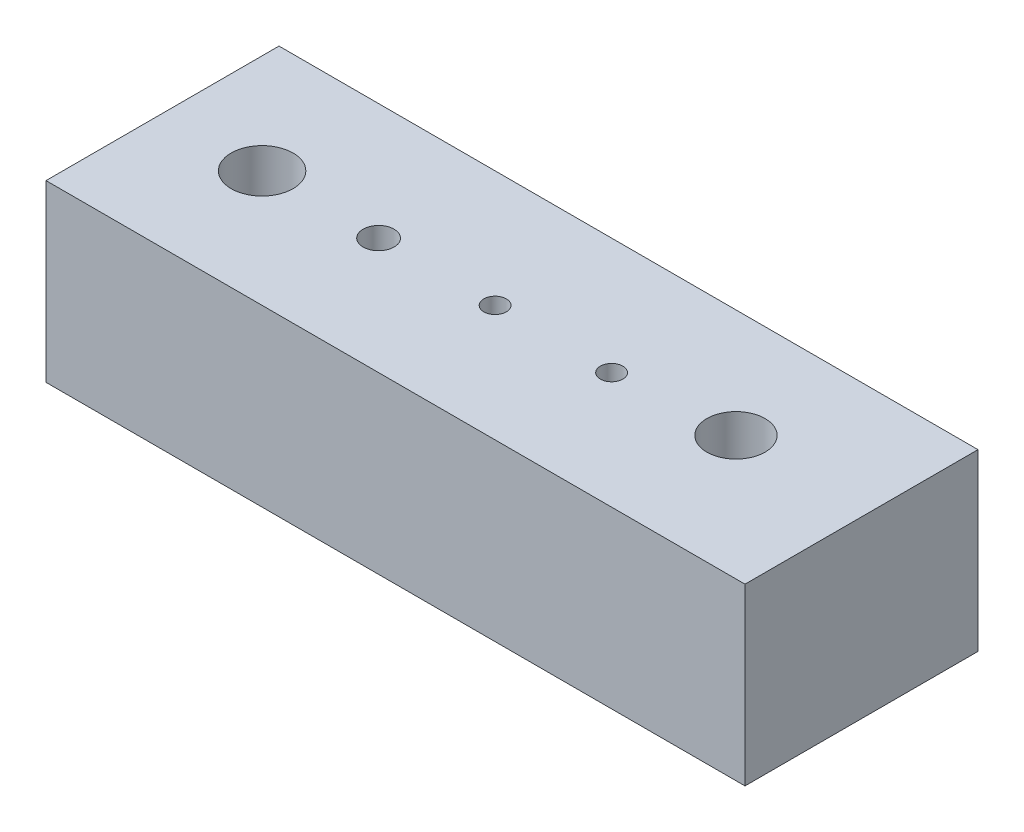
from build123d import *

# Parameters (mm, degrees)
SKETCH1_W                        = 152.4
SKETCH1_H                        = 50.8
BOSS_EXTRUDE1_DEPTH              = 38.1
F_1_2_CLEARANCE_HOLE2_D          = 13.49248
F_1_4_CLEARANCE_HOLE1_D          = 6.7564
F_1_4_CLEARANCE_HOLE1_DEPTH      = 38.1
F_1_4_CLEARANCE_HOLE1_TIP        = 2.029827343
F_10_0_1935_DIAMETER_HOLE1_D     = 4.9149
F_10_0_1935_DIAMETER_HOLE1_DEPTH = 38.1
F_10_0_1935_DIAMETER_HOLE1_TIP   = 1.476584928
F_10_0_1935_DIAMETER_HOLE2_D     = 4.9149
F_10_0_1935_DIAMETER_HOLE2_DEPTH = 38.1
F_10_0_1935_DIAMETER_HOLE2_TIP   = 1.476584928
F_1_2_0_5_DIAMETER_HOLE1_D       = 12.7
F_1_2_0_5_DIAMETER_HOLE1_DEPTH   = 38.1
F_1_2_0_5_DIAMETER_HOLE1_TIP     = 3.815464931


with BuildPart() as part:
    # Sketch1 → Boss-Extrude1 (new body)
    with BuildSketch(Plane(origin=(0, 0, 0), x_dir=(1, 0, 0), z_dir=(0, 1, 0))):
        with Locations((76.2, 25.4)):
            Rectangle(SKETCH1_W, SKETCH1_H)
    extrude(amount=BOSS_EXTRUDE1_DEPTH)

    # 1_2 Clearance Hole2 (through all)
    with Locations(Plane(origin=(0, 38.1, 0), x_dir=(1, 0, 0), z_dir=(0, 1, 0))):
        with Locations((21.717, 25.4)):
            Hole(F_1_2_CLEARANCE_HOLE2_D / 2)

    # 1_4 Clearance Hole1
    with Locations(Plane(origin=(0, 38.1, 0), x_dir=(1, 0, 0), z_dir=(0, 1, 0))):
        with Locations((47.117, 25.4)):
            Hole(F_1_4_CLEARANCE_HOLE1_D / 2, depth=F_1_4_CLEARANCE_HOLE1_DEPTH)
            with Locations((0, 0, -(F_1_4_CLEARANCE_HOLE1_DEPTH + F_1_4_CLEARANCE_HOLE1_TIP / 2))):  # 118° drill point
                Cone(0, F_1_4_CLEARANCE_HOLE1_D / 2, F_1_4_CLEARANCE_HOLE1_TIP, mode=Mode.SUBTRACT)

    # 10 _0.1935_ Diameter Hole1
    with Locations(Plane(origin=(0, 38.1, 0), x_dir=(1, 0, 0), z_dir=(0, 1, 0))):
        with Locations((72.517, 25.4)):
            Hole(F_10_0_1935_DIAMETER_HOLE1_D / 2, depth=F_10_0_1935_DIAMETER_HOLE1_DEPTH)
            with Locations((0, 0, -(F_10_0_1935_DIAMETER_HOLE1_DEPTH + F_10_0_1935_DIAMETER_HOLE1_TIP / 2))):  # 118° drill point
                Cone(0, F_10_0_1935_DIAMETER_HOLE1_D / 2, F_10_0_1935_DIAMETER_HOLE1_TIP, mode=Mode.SUBTRACT)

    # 10 _0.1935_ Diameter Hole2
    with Locations(Plane(origin=(0, 38.1, 0), x_dir=(1, 0, 0), z_dir=(0, 1, 0))):
        with Locations((97.917, 25.4)):
            Hole(F_10_0_1935_DIAMETER_HOLE2_D / 2, depth=F_10_0_1935_DIAMETER_HOLE2_DEPTH)
            with Locations((0, 0, -(F_10_0_1935_DIAMETER_HOLE2_DEPTH + F_10_0_1935_DIAMETER_HOLE2_TIP / 2))):  # 118° drill point
                Cone(0, F_10_0_1935_DIAMETER_HOLE2_D / 2, F_10_0_1935_DIAMETER_HOLE2_TIP, mode=Mode.SUBTRACT)

    # 1_2 _0.5_ Diameter Hole1
    with Locations(Plane(origin=(0, 38.1, 0), x_dir=(1, 0, 0), z_dir=(0, 1, 0))):
        with Locations((123.317, 27.114215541)):
            Hole(F_1_2_0_5_DIAMETER_HOLE1_D / 2, depth=F_1_2_0_5_DIAMETER_HOLE1_DEPTH)
            with Locations((0, 0, -(F_1_2_0_5_DIAMETER_HOLE1_DEPTH + F_1_2_0_5_DIAMETER_HOLE1_TIP / 2))):  # 118° drill point
                Cone(0, F_1_2_0_5_DIAMETER_HOLE1_D / 2, F_1_2_0_5_DIAMETER_HOLE1_TIP, mode=Mode.SUBTRACT)


solid = part.part
